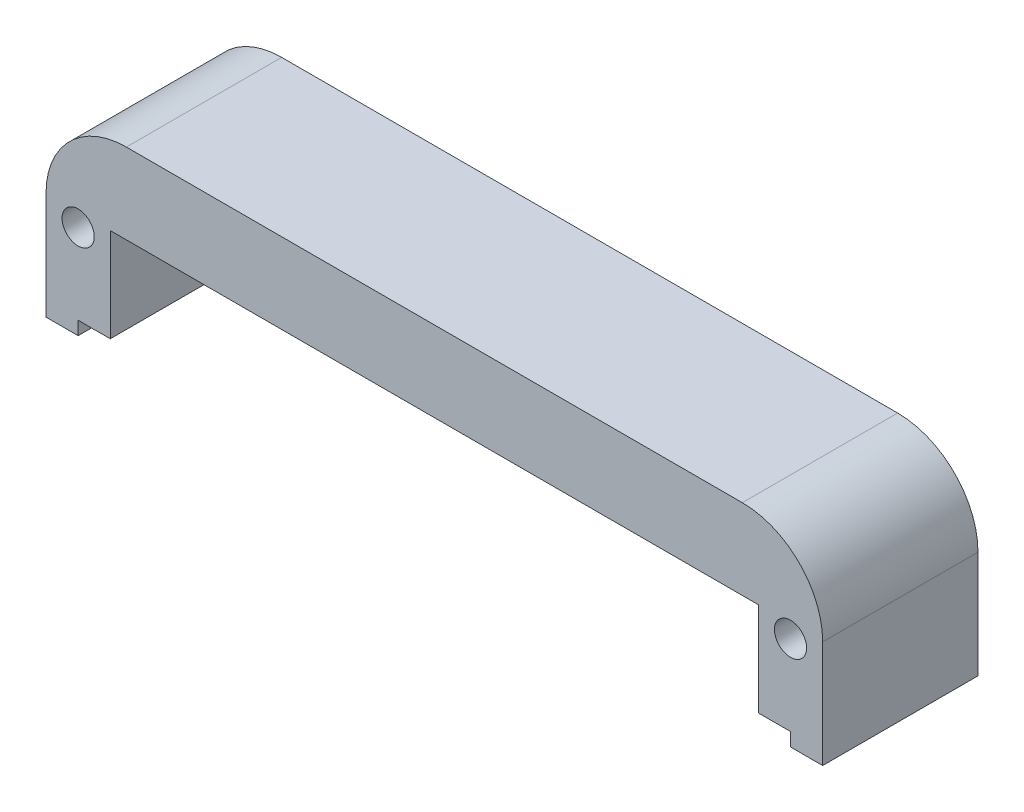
ISO-10303-21;
HEADER;
FILE_DESCRIPTION(('STEP AP214'),'2;1');
FILE_NAME('part.step','',(''),(''),'','','');
FILE_SCHEMA(('AUTOMOTIVE_DESIGN { 1 0 10303 214 1 1 1 1 }'));
ENDSEC;
DATA;
#1=APPLICATION_CONTEXT('core data for automotive mechanical design processes');
#2=APPLICATION_PROTOCOL_DEFINITION('international standard','automotive_design',2000,#1);
#3=PRODUCT_CONTEXT('',#1,'mechanical');
#4=PRODUCT('Part','Part','',(#3));
#5=PRODUCT_RELATED_PRODUCT_CATEGORY('part','',(#4));
#6=PRODUCT_DEFINITION_FORMATION('','',#4);
#7=PRODUCT_DEFINITION_CONTEXT('part definition',#1,'design');
#8=PRODUCT_DEFINITION('design','',#6,#7);
#9=PRODUCT_DEFINITION_SHAPE('','',#8);
#10=(LENGTH_UNIT() NAMED_UNIT(*) SI_UNIT(.MILLI.,.METRE.));
#11=(NAMED_UNIT(*) PLANE_ANGLE_UNIT() SI_UNIT($,.RADIAN.));
#12=(NAMED_UNIT(*) SI_UNIT($,.STERADIAN.) SOLID_ANGLE_UNIT());
#13=UNCERTAINTY_MEASURE_WITH_UNIT(LENGTH_MEASURE(1.E-05),#10,'distance_accuracy_value','');
#14=(GEOMETRIC_REPRESENTATION_CONTEXT(3) GLOBAL_UNCERTAINTY_ASSIGNED_CONTEXT((#13)) GLOBAL_UNIT_ASSIGNED_CONTEXT((#10,
#11,#12)) REPRESENTATION_CONTEXT('',''));
#15=CARTESIAN_POINT('',(0.,0.,0.));
#16=DIRECTION('',(0.,0.,1.));
#17=DIRECTION('',(1.,0.,0.));
#18=AXIS2_PLACEMENT_3D('',#15,#16,#17);
#19=CARTESIAN_POINT('',(-72.5,0.,90.));
#20=DIRECTION('',(1.,0.,0.));
#21=DIRECTION('',(0.,1.,0.));
#22=AXIS2_PLACEMENT_3D('',#19,#20,#21);
#23=PLANE('',#22);
#24=DIRECTION('',(0.,-1.,0.));
#25=VECTOR('',#24,1.);
#26=CARTESIAN_POINT('',(-72.5,20.,60.));
#27=LINE('',#26,#25);
#28=CARTESIAN_POINT('',(-72.5,20.,60.));
#29=VERTEX_POINT('',#28);
#30=CARTESIAN_POINT('',(-72.5,0.,60.));
#31=VERTEX_POINT('',#30);
#32=EDGE_CURVE('E160',#29,#31,#27,.T.);
#33=ORIENTED_EDGE('',*,*,#32,.F.);
#34=DIRECTION('',(0.,0.,-1.));
#35=VECTOR('',#34,1.);
#36=CARTESIAN_POINT('',(-72.5,20.,90.));
#37=LINE('',#36,#35);
#38=CARTESIAN_POINT('',(-72.5,20.,31.));
#39=VERTEX_POINT('',#38);
#40=EDGE_CURVE('E172',#29,#39,#37,.T.);
#41=ORIENTED_EDGE('',*,*,#40,.T.);
#42=DIRECTION('',(0.,-1.,0.));
#43=VECTOR('',#42,1.);
#44=CARTESIAN_POINT('',(-72.5,20.,31.));
#45=LINE('',#44,#43);
#46=CARTESIAN_POINT('',(-72.5,0.,31.));
#47=VERTEX_POINT('',#46);
#48=EDGE_CURVE('E264',#39,#47,#45,.T.);
#49=ORIENTED_EDGE('',*,*,#48,.T.);
#50=DIRECTION('',(0.,0.,-1.));
#51=VECTOR('',#50,1.);
#52=CARTESIAN_POINT('',(-72.5,0.,90.));
#53=LINE('',#52,#51);
#54=EDGE_CURVE('E174',#31,#47,#53,.T.);
#55=ORIENTED_EDGE('',*,*,#54,.F.);
#56=EDGE_LOOP('',(#33,#41,#49,#55));
#57=FACE_BOUND('',#56,.T.);
#58=ADVANCED_FACE('F36',(#57),#23,.F.);
#59=CARTESIAN_POINT('',(72.5,0.,90.));
#60=DIRECTION('',(0.,1.,0.));
#61=DIRECTION('',(0.,0.,1.));
#62=AXIS2_PLACEMENT_3D('',#59,#60,#61);
#63=PLANE('',#62);
#64=DIRECTION('',(1.,0.,0.));
#65=VECTOR('',#64,1.);
#66=CARTESIAN_POINT('',(-72.5,0.,60.));
#67=LINE('',#66,#65);
#68=CARTESIAN_POINT('',(-66.5,0.,60.));
#69=VERTEX_POINT('',#68);
#70=EDGE_CURVE('E373',#31,#69,#67,.T.);
#71=ORIENTED_EDGE('',*,*,#70,.F.);
#72=ORIENTED_EDGE('',*,*,#54,.T.);
#73=DIRECTION('',(1.,0.,0.));
#74=VECTOR('',#73,1.);
#75=CARTESIAN_POINT('',(-72.5,0.,31.));
#76=LINE('',#75,#74);
#77=CARTESIAN_POINT('',(-66.5,0.,31.));
#78=VERTEX_POINT('',#77);
#79=EDGE_CURVE('E267',#47,#78,#76,.T.);
#80=ORIENTED_EDGE('',*,*,#79,.T.);
#81=DIRECTION('',(0.,0.,-1.));
#82=VECTOR('',#81,1.);
#83=CARTESIAN_POINT('',(-66.5,0.,78.5));
#84=LINE('',#83,#82);
#85=EDGE_CURVE('E229',#69,#78,#84,.T.);
#86=ORIENTED_EDGE('',*,*,#85,.F.);
#87=EDGE_LOOP('',(#71,#72,#80,#86));
#88=FACE_BOUND('',#87,.T.);
#89=ADVANCED_FACE('F318',(#88),#63,.F.);
#90=CARTESIAN_POINT('',(66.5,0.,60.));
#91=VERTEX_POINT('',#90);
#92=CARTESIAN_POINT('',(72.5,0.,60.));
#93=VERTEX_POINT('',#92);
#94=EDGE_CURVE('E175',#91,#93,#67,.T.);
#95=ORIENTED_EDGE('',*,*,#94,.F.);
#96=DIRECTION('',(0.,0.,1.));
#97=VECTOR('',#96,1.);
#98=CARTESIAN_POINT('',(66.5,0.,78.5));
#99=LINE('',#98,#97);
#100=CARTESIAN_POINT('',(66.5,0.,31.));
#101=VERTEX_POINT('',#100);
#102=EDGE_CURVE('E233',#101,#91,#99,.T.);
#103=ORIENTED_EDGE('',*,*,#102,.F.);
#104=CARTESIAN_POINT('',(72.5,0.,31.));
#105=VERTEX_POINT('',#104);
#106=EDGE_CURVE('E266',#101,#105,#76,.T.);
#107=ORIENTED_EDGE('',*,*,#106,.T.);
#108=DIRECTION('',(0.,0.,-1.));
#109=VECTOR('',#108,1.);
#110=CARTESIAN_POINT('',(72.5,0.,90.));
#111=LINE('',#110,#109);
#112=EDGE_CURVE('E193',#93,#105,#111,.T.);
#113=ORIENTED_EDGE('',*,*,#112,.F.);
#114=EDGE_LOOP('',(#95,#103,#107,#113));
#115=FACE_BOUND('',#114,.T.);
#116=ADVANCED_FACE('F323',(#115),#63,.F.);
#117=CARTESIAN_POINT('',(72.5,20.,90.));
#118=DIRECTION('',(-1.,0.,0.));
#119=DIRECTION('',(0.,-1.,0.));
#120=AXIS2_PLACEMENT_3D('',#117,#118,#119);
#121=PLANE('',#120);
#122=DIRECTION('',(0.,1.,0.));
#123=VECTOR('',#122,1.);
#124=CARTESIAN_POINT('',(72.5,0.,60.));
#125=LINE('',#124,#123);
#126=CARTESIAN_POINT('',(72.5,20.,60.));
#127=VERTEX_POINT('',#126);
#128=EDGE_CURVE('E374',#93,#127,#125,.T.);
#129=ORIENTED_EDGE('',*,*,#128,.F.);
#130=ORIENTED_EDGE('',*,*,#112,.T.);
#131=DIRECTION('',(0.,1.,0.));
#132=VECTOR('',#131,1.);
#133=CARTESIAN_POINT('',(72.5,0.,31.));
#134=LINE('',#133,#132);
#135=CARTESIAN_POINT('',(72.5,20.,31.));
#136=VERTEX_POINT('',#135);
#137=EDGE_CURVE('E270',#105,#136,#134,.T.);
#138=ORIENTED_EDGE('',*,*,#137,.T.);
#139=DIRECTION('',(0.,0.,-1.));
#140=VECTOR('',#139,1.);
#141=CARTESIAN_POINT('',(72.5,20.,90.));
#142=LINE('',#141,#140);
#143=EDGE_CURVE('E191',#127,#136,#142,.T.);
#144=ORIENTED_EDGE('',*,*,#143,.F.);
#145=EDGE_LOOP('',(#129,#130,#138,#144));
#146=FACE_BOUND('',#145,.T.);
#147=ADVANCED_FACE('F326',(#146),#121,.F.);
#148=CARTESIAN_POINT('',(57.5,20.,90.));
#149=DIRECTION('',(0.,0.,-1.));
#150=DIRECTION('',(-1.,0.,0.));
#151=AXIS2_PLACEMENT_3D('',#148,#149,#150);
#152=CYLINDRICAL_SURFACE('',#151,15.);
#153=CARTESIAN_POINT('',(57.5,20.,60.));
#154=DIRECTION('',(0.,0.,1.));
#155=DIRECTION('',(1.,0.,0.));
#156=AXIS2_PLACEMENT_3D('',#153,#154,#155);
#157=CIRCLE('',#156,15.);
#158=CARTESIAN_POINT('',(57.5,35.,60.));
#159=VERTEX_POINT('',#158);
#160=EDGE_CURVE('E376',#127,#159,#157,.T.);
#161=ORIENTED_EDGE('',*,*,#160,.F.);
#162=ORIENTED_EDGE('',*,*,#143,.T.);
#163=CARTESIAN_POINT('',(57.5,20.,31.));
#164=DIRECTION('',(0.,0.,1.));
#165=DIRECTION('',(1.,0.,0.));
#166=AXIS2_PLACEMENT_3D('',#163,#164,#165);
#167=CIRCLE('',#166,15.);
#168=CARTESIAN_POINT('',(57.5,35.,31.));
#169=VERTEX_POINT('',#168);
#170=EDGE_CURVE('E273',#136,#169,#167,.T.);
#171=ORIENTED_EDGE('',*,*,#170,.T.);
#172=DIRECTION('',(0.,0.,-1.));
#173=VECTOR('',#172,1.);
#174=CARTESIAN_POINT('',(57.5,35.,90.));
#175=LINE('',#174,#173);
#176=EDGE_CURVE('E184',#159,#169,#175,.T.);
#177=ORIENTED_EDGE('',*,*,#176,.F.);
#178=EDGE_LOOP('',(#161,#162,#171,#177));
#179=FACE_BOUND('',#178,.T.);
#180=ADVANCED_FACE('F331',(#179),#152,.T.);
#181=CARTESIAN_POINT('',(-57.5,35.,90.));
#182=DIRECTION('',(0.,-1.,0.));
#183=DIRECTION('',(1.,0.,0.));
#184=AXIS2_PLACEMENT_3D('',#181,#182,#183);
#185=PLANE('',#184);
#186=DIRECTION('',(-1.,0.,0.));
#187=VECTOR('',#186,1.);
#188=CARTESIAN_POINT('',(57.5,35.,60.));
#189=LINE('',#188,#187);
#190=CARTESIAN_POINT('',(-57.5,35.,60.));
#191=VERTEX_POINT('',#190);
#192=EDGE_CURVE('E163',#159,#191,#189,.T.);
#193=ORIENTED_EDGE('',*,*,#192,.F.);
#194=ORIENTED_EDGE('',*,*,#176,.T.);
#195=DIRECTION('',(-1.,0.,0.));
#196=VECTOR('',#195,1.);
#197=CARTESIAN_POINT('',(57.5,35.,31.));
#198=LINE('',#197,#196);
#199=CARTESIAN_POINT('',(-57.5,35.,31.));
#200=VERTEX_POINT('',#199);
#201=EDGE_CURVE('E276',#169,#200,#198,.T.);
#202=ORIENTED_EDGE('',*,*,#201,.T.);
#203=DIRECTION('',(0.,0.,-1.));
#204=VECTOR('',#203,1.);
#205=CARTESIAN_POINT('',(-57.5,35.,90.));
#206=LINE('',#205,#204);
#207=EDGE_CURVE('E181',#191,#200,#206,.T.);
#208=ORIENTED_EDGE('',*,*,#207,.F.);
#209=EDGE_LOOP('',(#193,#194,#202,#208));
#210=FACE_BOUND('',#209,.T.);
#211=ADVANCED_FACE('F335',(#210),#185,.F.);
#212=CARTESIAN_POINT('',(-57.5,20.,90.));
#213=DIRECTION('',(0.,0.,-1.));
#214=DIRECTION('',(-1.,0.,0.));
#215=AXIS2_PLACEMENT_3D('',#212,#213,#214);
#216=CYLINDRICAL_SURFACE('',#215,15.);
#217=CARTESIAN_POINT('',(-57.5,20.,60.));
#218=DIRECTION('',(0.,0.,1.));
#219=DIRECTION('',(1.,0.,0.));
#220=AXIS2_PLACEMENT_3D('',#217,#218,#219);
#221=CIRCLE('',#220,15.);
#222=EDGE_CURVE('E157',#191,#29,#221,.T.);
#223=ORIENTED_EDGE('',*,*,#222,.F.);
#224=ORIENTED_EDGE('',*,*,#207,.T.);
#225=CARTESIAN_POINT('',(-57.5,20.,31.));
#226=DIRECTION('',(0.,0.,1.));
#227=DIRECTION('',(1.,0.,0.));
#228=AXIS2_PLACEMENT_3D('',#225,#226,#227);
#229=CIRCLE('',#228,15.);
#230=EDGE_CURVE('E180',#200,#39,#229,.T.);
#231=ORIENTED_EDGE('',*,*,#230,.T.);
#232=ORIENTED_EDGE('',*,*,#40,.F.);
#233=EDGE_LOOP('',(#223,#224,#231,#232));
#234=FACE_BOUND('',#233,.T.);
#235=ADVANCED_FACE('F178',(#234),#216,.T.);
#236=CARTESIAN_POINT('',(63.5,2.5,78.5));
#237=DIRECTION('',(0.,1.,0.));
#238=DIRECTION('',(0.,0.,1.));
#239=AXIS2_PLACEMENT_3D('',#236,#237,#238);
#240=PLANE('',#239);
#241=DIRECTION('',(1.,0.,0.));
#242=VECTOR('',#241,1.);
#243=CARTESIAN_POINT('',(63.5,2.5,60.));
#244=LINE('',#243,#242);
#245=CARTESIAN_POINT('',(-66.5,2.5,60.));
#246=VERTEX_POINT('',#245);
#247=CARTESIAN_POINT('',(-60.5,2.5,60.));
#248=VERTEX_POINT('',#247);
#249=EDGE_CURVE('E49',#246,#248,#244,.T.);
#250=ORIENTED_EDGE('',*,*,#249,.F.);
#251=DIRECTION('',(0.,0.,-1.));
#252=VECTOR('',#251,1.);
#253=CARTESIAN_POINT('',(-66.5,2.5,78.5));
#254=LINE('',#253,#252);
#255=CARTESIAN_POINT('',(-66.5,2.5,31.));
#256=VERTEX_POINT('',#255);
#257=EDGE_CURVE('E230',#246,#256,#254,.T.);
#258=ORIENTED_EDGE('',*,*,#257,.T.);
#259=DIRECTION('',(1.,0.,0.));
#260=VECTOR('',#259,1.);
#261=CARTESIAN_POINT('',(63.5,2.5,31.));
#262=LINE('',#261,#260);
#263=CARTESIAN_POINT('',(-60.5,2.5,31.));
#264=VERTEX_POINT('',#263);
#265=EDGE_CURVE('E287',#256,#264,#262,.T.);
#266=ORIENTED_EDGE('',*,*,#265,.T.);
#267=DIRECTION('',(0.,0.,-1.));
#268=VECTOR('',#267,1.);
#269=CARTESIAN_POINT('',(-60.5,2.5,76.5));
#270=LINE('',#269,#268);
#271=EDGE_CURVE('E236',#248,#264,#270,.T.);
#272=ORIENTED_EDGE('',*,*,#271,.F.);
#273=EDGE_LOOP('',(#250,#258,#266,#272));
#274=FACE_BOUND('',#273,.T.);
#275=ADVANCED_FACE('F342',(#274),#240,.F.);
#276=CARTESIAN_POINT('',(60.5,2.5,60.));
#277=VERTEX_POINT('',#276);
#278=CARTESIAN_POINT('',(66.5,2.5,60.));
#279=VERTEX_POINT('',#278);
#280=EDGE_CURVE('E256',#277,#279,#244,.T.);
#281=ORIENTED_EDGE('',*,*,#280,.F.);
#282=DIRECTION('',(0.,0.,1.));
#283=VECTOR('',#282,1.);
#284=CARTESIAN_POINT('',(60.5,2.5,76.5));
#285=LINE('',#284,#283);
#286=CARTESIAN_POINT('',(60.5,2.5,31.));
#287=VERTEX_POINT('',#286);
#288=EDGE_CURVE('E196',#287,#277,#285,.T.);
#289=ORIENTED_EDGE('',*,*,#288,.F.);
#290=CARTESIAN_POINT('',(66.5,2.5,31.));
#291=VERTEX_POINT('',#290);
#292=EDGE_CURVE('E290',#287,#291,#262,.T.);
#293=ORIENTED_EDGE('',*,*,#292,.T.);
#294=DIRECTION('',(0.,0.,1.));
#295=VECTOR('',#294,1.);
#296=CARTESIAN_POINT('',(66.5,2.5,78.5));
#297=LINE('',#296,#295);
#298=EDGE_CURVE('E232',#291,#279,#297,.T.);
#299=ORIENTED_EDGE('',*,*,#298,.T.);
#300=EDGE_LOOP('',(#281,#289,#293,#299));
#301=FACE_BOUND('',#300,.T.);
#302=ADVANCED_FACE('F358',(#301),#240,.F.);
#303=CARTESIAN_POINT('',(66.5,2.5,78.5));
#304=DIRECTION('',(1.,0.,0.));
#305=DIRECTION('',(0.,0.,-1.));
#306=AXIS2_PLACEMENT_3D('',#303,#304,#305);
#307=PLANE('',#306);
#308=DIRECTION('',(0.,-1.,0.));
#309=VECTOR('',#308,1.);
#310=CARTESIAN_POINT('',(66.5,2.5,60.));
#311=LINE('',#310,#309);
#312=EDGE_CURVE('E261',#279,#91,#311,.T.);
#313=ORIENTED_EDGE('',*,*,#312,.F.);
#314=ORIENTED_EDGE('',*,*,#298,.F.);
#315=DIRECTION('',(0.,-1.,0.));
#316=VECTOR('',#315,1.);
#317=CARTESIAN_POINT('',(66.5,2.5,31.));
#318=LINE('',#317,#316);
#319=EDGE_CURVE('E295',#291,#101,#318,.T.);
#320=ORIENTED_EDGE('',*,*,#319,.T.);
#321=ORIENTED_EDGE('',*,*,#102,.T.);
#322=EDGE_LOOP('',(#313,#314,#320,#321));
#323=FACE_BOUND('',#322,.T.);
#324=ADVANCED_FACE('F354',(#323),#307,.F.);
#325=CARTESIAN_POINT('',(-66.5,2.5,78.5));
#326=DIRECTION('',(-1.,0.,0.));
#327=DIRECTION('',(0.,0.,1.));
#328=AXIS2_PLACEMENT_3D('',#325,#326,#327);
#329=PLANE('',#328);
#330=DIRECTION('',(0.,1.,0.));
#331=VECTOR('',#330,1.);
#332=CARTESIAN_POINT('',(-66.5,2.5,60.));
#333=LINE('',#332,#331);
#334=EDGE_CURVE('E254',#69,#246,#333,.T.);
#335=ORIENTED_EDGE('',*,*,#334,.F.);
#336=ORIENTED_EDGE('',*,*,#85,.T.);
#337=DIRECTION('',(0.,1.,0.));
#338=VECTOR('',#337,1.);
#339=CARTESIAN_POINT('',(-66.5,2.5,31.));
#340=LINE('',#339,#338);
#341=EDGE_CURVE('E292',#78,#256,#340,.T.);
#342=ORIENTED_EDGE('',*,*,#341,.T.);
#343=ORIENTED_EDGE('',*,*,#257,.F.);
#344=EDGE_LOOP('',(#335,#336,#342,#343));
#345=FACE_BOUND('',#344,.T.);
#346=ADVANCED_FACE('F351',(#345),#329,.F.);
#347=CARTESIAN_POINT('',(0.,20.,0.));
#348=DIRECTION('',(0.,1.,0.));
#349=DIRECTION('',(0.,0.,1.));
#350=AXIS2_PLACEMENT_3D('',#347,#348,#349);
#351=PLANE('',#350);
#352=DIRECTION('',(1.,0.,0.));
#353=VECTOR('',#352,1.);
#354=CARTESIAN_POINT('',(0.,20.,60.));
#355=LINE('',#354,#353);
#356=CARTESIAN_POINT('',(-60.5,20.,60.));
#357=VERTEX_POINT('',#356);
#358=CARTESIAN_POINT('',(60.5,20.,60.));
#359=VERTEX_POINT('',#358);
#360=EDGE_CURVE('E243',#357,#359,#355,.T.);
#361=ORIENTED_EDGE('',*,*,#360,.F.);
#362=DIRECTION('',(0.,0.,-1.));
#363=VECTOR('',#362,1.);
#364=CARTESIAN_POINT('',(-60.5,20.,76.5));
#365=LINE('',#364,#363);
#366=CARTESIAN_POINT('',(-60.5,20.,31.));
#367=VERTEX_POINT('',#366);
#368=EDGE_CURVE('E182',#357,#367,#365,.T.);
#369=ORIENTED_EDGE('',*,*,#368,.T.);
#370=DIRECTION('',(1.,0.,0.));
#371=VECTOR('',#370,1.);
#372=CARTESIAN_POINT('',(0.,20.,31.));
#373=LINE('',#372,#371);
#374=CARTESIAN_POINT('',(-9.19258240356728,20.,31.));
#375=VERTEX_POINT('',#374);
#376=EDGE_CURVE('E280',#367,#375,#373,.T.);
#377=ORIENTED_EDGE('',*,*,#376,.T.);
#378=DIRECTION('',(0.,0.,-1.));
#379=VECTOR('',#378,1.);
#380=CARTESIAN_POINT('',(-9.19258240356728,20.,33.5));
#381=LINE('',#380,#379);
#382=CARTESIAN_POINT('',(-9.19258240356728,20.,33.5));
#383=VERTEX_POINT('',#382);
#384=EDGE_CURVE('E211',#375,#383,#381,.F.);
#385=ORIENTED_EDGE('',*,*,#384,.T.);
#386=DIRECTION('',(-1.,0.,0.));
#387=VECTOR('',#386,1.);
#388=CARTESIAN_POINT('',(0.,20.,33.5));
#389=LINE('',#388,#387);
#390=CARTESIAN_POINT('',(-3.80741759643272,20.,33.5));
#391=VERTEX_POINT('',#390);
#392=EDGE_CURVE('E199',#391,#383,#389,.T.);
#393=ORIENTED_EDGE('',*,*,#392,.F.);
#394=DIRECTION('',(0.,0.,-1.));
#395=VECTOR('',#394,1.);
#396=CARTESIAN_POINT('',(-3.80741759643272,20.,33.5));
#397=LINE('',#396,#395);
#398=CARTESIAN_POINT('',(-3.80741759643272,20.,31.));
#399=VERTEX_POINT('',#398);
#400=EDGE_CURVE('E209',#391,#399,#397,.T.);
#401=ORIENTED_EDGE('',*,*,#400,.T.);
#402=CARTESIAN_POINT('',(9.80741759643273,20.,31.));
#403=VERTEX_POINT('',#402);
#404=EDGE_CURVE('E57',#399,#403,#373,.T.);
#405=ORIENTED_EDGE('',*,*,#404,.T.);
#406=DIRECTION('',(0.,0.,-1.));
#407=VECTOR('',#406,1.);
#408=CARTESIAN_POINT('',(9.80741759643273,20.,33.5));
#409=LINE('',#408,#407);
#410=CARTESIAN_POINT('',(9.80741759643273,20.,33.5));
#411=VERTEX_POINT('',#410);
#412=EDGE_CURVE('E219',#403,#411,#409,.F.);
#413=ORIENTED_EDGE('',*,*,#412,.T.);
#414=DIRECTION('',(-1.,0.,0.));
#415=VECTOR('',#414,1.);
#416=CARTESIAN_POINT('',(0.,20.,33.5));
#417=LINE('',#416,#415);
#418=CARTESIAN_POINT('',(15.1925824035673,20.,33.5));
#419=VERTEX_POINT('',#418);
#420=EDGE_CURVE('E202',#419,#411,#417,.T.);
#421=ORIENTED_EDGE('',*,*,#420,.F.);
#422=DIRECTION('',(0.,0.,-1.));
#423=VECTOR('',#422,1.);
#424=CARTESIAN_POINT('',(15.1925824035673,20.,33.5));
#425=LINE('',#424,#423);
#426=CARTESIAN_POINT('',(15.1925824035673,20.,31.));
#427=VERTEX_POINT('',#426);
#428=EDGE_CURVE('E221',#419,#427,#425,.T.);
#429=ORIENTED_EDGE('',*,*,#428,.T.);
#430=CARTESIAN_POINT('',(60.5,20.,31.));
#431=VERTEX_POINT('',#430);
#432=EDGE_CURVE('E245',#427,#431,#373,.T.);
#433=ORIENTED_EDGE('',*,*,#432,.T.);
#434=DIRECTION('',(0.,0.,1.));
#435=VECTOR('',#434,1.);
#436=CARTESIAN_POINT('',(60.5,20.,76.5));
#437=LINE('',#436,#435);
#438=EDGE_CURVE('E186',#431,#359,#437,.T.);
#439=ORIENTED_EDGE('',*,*,#438,.T.);
#440=EDGE_LOOP('',(#361,#369,#377,#385,#393,#401,#405,#413,#421,#429,#433,#439));
#441=FACE_BOUND('',#440,.T.);
#442=ADVANCED_FACE('F217',(#441),#351,.F.);
#443=CARTESIAN_POINT('',(60.5,20.,76.5));
#444=DIRECTION('',(1.,0.,0.));
#445=DIRECTION('',(0.,0.,-1.));
#446=AXIS2_PLACEMENT_3D('',#443,#444,#445);
#447=PLANE('',#446);
#448=DIRECTION('',(0.,-1.,0.));
#449=VECTOR('',#448,1.);
#450=CARTESIAN_POINT('',(60.5,20.,60.));
#451=LINE('',#450,#449);
#452=EDGE_CURVE('E252',#359,#277,#451,.T.);
#453=ORIENTED_EDGE('',*,*,#452,.F.);
#454=ORIENTED_EDGE('',*,*,#438,.F.);
#455=DIRECTION('',(0.,-1.,0.));
#456=VECTOR('',#455,1.);
#457=CARTESIAN_POINT('',(60.5,20.,31.));
#458=LINE('',#457,#456);
#459=EDGE_CURVE('E250',#431,#287,#458,.T.);
#460=ORIENTED_EDGE('',*,*,#459,.T.);
#461=ORIENTED_EDGE('',*,*,#288,.T.);
#462=EDGE_LOOP('',(#453,#454,#460,#461));
#463=FACE_BOUND('',#462,.T.);
#464=ADVANCED_FACE('F249',(#463),#447,.F.);
#465=CARTESIAN_POINT('',(-60.5,20.,76.5));
#466=DIRECTION('',(-1.,0.,0.));
#467=DIRECTION('',(0.,0.,1.));
#468=AXIS2_PLACEMENT_3D('',#465,#466,#467);
#469=PLANE('',#468);
#470=DIRECTION('',(0.,1.,0.));
#471=VECTOR('',#470,1.);
#472=CARTESIAN_POINT('',(-60.5,20.,60.));
#473=LINE('',#472,#471);
#474=EDGE_CURVE('E11',#248,#357,#473,.T.);
#475=ORIENTED_EDGE('',*,*,#474,.F.);
#476=ORIENTED_EDGE('',*,*,#271,.T.);
#477=DIRECTION('',(0.,1.,0.));
#478=VECTOR('',#477,1.);
#479=CARTESIAN_POINT('',(-60.5,20.,31.));
#480=LINE('',#479,#478);
#481=EDGE_CURVE('E284',#264,#367,#480,.T.);
#482=ORIENTED_EDGE('',*,*,#481,.T.);
#483=ORIENTED_EDGE('',*,*,#368,.F.);
#484=EDGE_LOOP('',(#475,#476,#482,#483));
#485=FACE_BOUND('',#484,.T.);
#486=ADVANCED_FACE('F345',(#485),#469,.F.);
#487=CARTESIAN_POINT('',(12.5,13.,33.5));
#488=DIRECTION('',(0.,0.,-1.));
#489=DIRECTION('',(-1.,0.,0.));
#490=AXIS2_PLACEMENT_3D('',#487,#488,#489);
#491=PLANE('',#490);
#492=ORIENTED_EDGE('',*,*,#420,.T.);
#493=CARTESIAN_POINT('',(12.5,13.,33.5));
#494=DIRECTION('',(0.,0.,-1.));
#495=DIRECTION('',(-1.,0.,0.));
#496=AXIS2_PLACEMENT_3D('',#493,#494,#495);
#497=CIRCLE('',#496,7.5);
#498=EDGE_CURVE('E223',#411,#419,#497,.T.);
#499=ORIENTED_EDGE('',*,*,#498,.T.);
#500=EDGE_LOOP('',(#492,#499));
#501=FACE_BOUND('',#500,.T.);
#502=ADVANCED_FACE('F314',(#501),#491,.T.);
#503=CARTESIAN_POINT('',(12.5,13.,33.5));
#504=DIRECTION('',(0.,0.,-1.));
#505=DIRECTION('',(-1.,0.,0.));
#506=AXIS2_PLACEMENT_3D('',#503,#504,#505);
#507=CYLINDRICAL_SURFACE('',#506,7.5);
#508=ORIENTED_EDGE('',*,*,#412,.F.);
#509=CARTESIAN_POINT('',(12.5,13.,31.));
#510=DIRECTION('',(0.,0.,1.));
#511=DIRECTION('',(1.,0.,0.));
#512=AXIS2_PLACEMENT_3D('',#509,#510,#511);
#513=CIRCLE('',#512,7.5);
#514=EDGE_CURVE('E281',#403,#427,#513,.F.);
#515=ORIENTED_EDGE('',*,*,#514,.T.);
#516=ORIENTED_EDGE('',*,*,#428,.F.);
#517=ORIENTED_EDGE('',*,*,#498,.F.);
#518=EDGE_LOOP('',(#508,#515,#516,#517));
#519=FACE_BOUND('',#518,.T.);
#520=ADVANCED_FACE('F303',(#519),#507,.F.);
#521=CARTESIAN_POINT('',(-6.5,13.,33.5));
#522=DIRECTION('',(0.,0.,-1.));
#523=DIRECTION('',(-1.,0.,0.));
#524=AXIS2_PLACEMENT_3D('',#521,#522,#523);
#525=PLANE('',#524);
#526=ORIENTED_EDGE('',*,*,#392,.T.);
#527=CARTESIAN_POINT('',(-6.5,13.,33.5));
#528=DIRECTION('',(0.,0.,-1.));
#529=DIRECTION('',(-1.,0.,0.));
#530=AXIS2_PLACEMENT_3D('',#527,#528,#529);
#531=CIRCLE('',#530,7.5);
#532=EDGE_CURVE('E298',#383,#391,#531,.T.);
#533=ORIENTED_EDGE('',*,*,#532,.T.);
#534=EDGE_LOOP('',(#526,#533));
#535=FACE_BOUND('',#534,.T.);
#536=ADVANCED_FACE('F301',(#535),#525,.T.);
#537=CARTESIAN_POINT('',(-6.5,13.,33.5));
#538=DIRECTION('',(0.,0.,-1.));
#539=DIRECTION('',(-1.,0.,0.));
#540=AXIS2_PLACEMENT_3D('',#537,#538,#539);
#541=CYLINDRICAL_SURFACE('',#540,7.5);
#542=ORIENTED_EDGE('',*,*,#384,.F.);
#543=CARTESIAN_POINT('',(-6.5,13.,31.));
#544=DIRECTION('',(0.,0.,1.));
#545=DIRECTION('',(1.,0.,0.));
#546=AXIS2_PLACEMENT_3D('',#543,#544,#545);
#547=CIRCLE('',#546,7.5);
#548=EDGE_CURVE('E43',#375,#399,#547,.F.);
#549=ORIENTED_EDGE('',*,*,#548,.T.);
#550=ORIENTED_EDGE('',*,*,#400,.F.);
#551=ORIENTED_EDGE('',*,*,#532,.F.);
#552=EDGE_LOOP('',(#542,#549,#550,#551));
#553=FACE_BOUND('',#552,.T.);
#554=ADVANCED_FACE('F207',(#553),#541,.F.);
#555=CARTESIAN_POINT('',(-57.5,20.,31.));
#556=DIRECTION('',(0.,0.,1.));
#557=DIRECTION('',(1.,0.,0.));
#558=AXIS2_PLACEMENT_3D('',#555,#556,#557);
#559=PLANE('',#558);
#560=CARTESIAN_POINT('',(-66.5,17.5,31.));
#561=DIRECTION('',(0.,0.,1.));
#562=DIRECTION('',(1.,0.,0.));
#563=AXIS2_PLACEMENT_3D('',#560,#561,#562);
#564=CIRCLE('',#563,3.00000000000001);
#565=CARTESIAN_POINT('',(-63.5,17.5,31.));
#566=VERTEX_POINT('',#565);
#567=EDGE_CURVE('E167',#566,#566,#564,.T.);
#568=ORIENTED_EDGE('',*,*,#567,.T.);
#569=EDGE_LOOP('',(#568));
#570=FACE_BOUND('',#569,.T.);
#571=CARTESIAN_POINT('',(66.5,17.5,31.));
#572=DIRECTION('',(0.,0.,1.));
#573=DIRECTION('',(1.,0.,0.));
#574=AXIS2_PLACEMENT_3D('',#571,#572,#573);
#575=CIRCLE('',#574,3.00000000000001);
#576=CARTESIAN_POINT('',(69.5,17.5,31.));
#577=VERTEX_POINT('',#576);
#578=EDGE_CURVE('E424',#577,#577,#575,.T.);
#579=ORIENTED_EDGE('',*,*,#578,.T.);
#580=EDGE_LOOP('',(#579));
#581=FACE_BOUND('',#580,.T.);
#582=ORIENTED_EDGE('',*,*,#292,.F.);
#583=ORIENTED_EDGE('',*,*,#459,.F.);
#584=ORIENTED_EDGE('',*,*,#432,.F.);
#585=ORIENTED_EDGE('',*,*,#514,.F.);
#586=ORIENTED_EDGE('',*,*,#404,.F.);
#587=ORIENTED_EDGE('',*,*,#548,.F.);
#588=ORIENTED_EDGE('',*,*,#376,.F.);
#589=ORIENTED_EDGE('',*,*,#481,.F.);
#590=ORIENTED_EDGE('',*,*,#265,.F.);
#591=ORIENTED_EDGE('',*,*,#341,.F.);
#592=ORIENTED_EDGE('',*,*,#79,.F.);
#593=ORIENTED_EDGE('',*,*,#48,.F.);
#594=ORIENTED_EDGE('',*,*,#230,.F.);
#595=ORIENTED_EDGE('',*,*,#201,.F.);
#596=ORIENTED_EDGE('',*,*,#170,.F.);
#597=ORIENTED_EDGE('',*,*,#137,.F.);
#598=ORIENTED_EDGE('',*,*,#106,.F.);
#599=ORIENTED_EDGE('',*,*,#319,.F.);
#600=EDGE_LOOP('',(#582,#583,#584,#585,#586,#587,#588,#589,#590,#591,#592,#593,#594,#595,#596,
#597,#598,#599));
#601=FACE_BOUND('',#600,.T.);
#602=ADVANCED_FACE('F311',(#570,#581,#601),#559,.F.);
#603=CARTESIAN_POINT('',(-57.5,20.,60.));
#604=DIRECTION('',(0.,0.,1.));
#605=DIRECTION('',(1.,0.,0.));
#606=AXIS2_PLACEMENT_3D('',#603,#604,#605);
#607=PLANE('',#606);
#608=CARTESIAN_POINT('',(-66.5,17.5,60.));
#609=DIRECTION('',(0.,0.,1.));
#610=DIRECTION('',(1.,0.,0.));
#611=AXIS2_PLACEMENT_3D('',#608,#609,#610);
#612=CIRCLE('',#611,3.00000000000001);
#613=CARTESIAN_POINT('',(-63.5,17.5,60.));
#614=VERTEX_POINT('',#613);
#615=EDGE_CURVE('E423',#614,#614,#612,.T.);
#616=ORIENTED_EDGE('',*,*,#615,.F.);
#617=EDGE_LOOP('',(#616));
#618=FACE_BOUND('',#617,.T.);
#619=CARTESIAN_POINT('',(66.5,17.5,60.));
#620=DIRECTION('',(0.,0.,1.));
#621=DIRECTION('',(1.,0.,0.));
#622=AXIS2_PLACEMENT_3D('',#619,#620,#621);
#623=CIRCLE('',#622,3.00000000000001);
#624=CARTESIAN_POINT('',(69.5,17.5,60.));
#625=VERTEX_POINT('',#624);
#626=EDGE_CURVE('E428',#625,#625,#623,.T.);
#627=ORIENTED_EDGE('',*,*,#626,.F.);
#628=EDGE_LOOP('',(#627));
#629=FACE_BOUND('',#628,.T.);
#630=ORIENTED_EDGE('',*,*,#312,.T.);
#631=ORIENTED_EDGE('',*,*,#94,.T.);
#632=ORIENTED_EDGE('',*,*,#128,.T.);
#633=ORIENTED_EDGE('',*,*,#160,.T.);
#634=ORIENTED_EDGE('',*,*,#192,.T.);
#635=ORIENTED_EDGE('',*,*,#222,.T.);
#636=ORIENTED_EDGE('',*,*,#32,.T.);
#637=ORIENTED_EDGE('',*,*,#70,.T.);
#638=ORIENTED_EDGE('',*,*,#334,.T.);
#639=ORIENTED_EDGE('',*,*,#249,.T.);
#640=ORIENTED_EDGE('',*,*,#474,.T.);
#641=ORIENTED_EDGE('',*,*,#360,.T.);
#642=ORIENTED_EDGE('',*,*,#452,.T.);
#643=ORIENTED_EDGE('',*,*,#280,.T.);
#644=EDGE_LOOP('',(#630,#631,#632,#633,#634,#635,#636,#637,#638,#639,#640,#641,#642,#643));
#645=FACE_BOUND('',#644,.T.);
#646=ADVANCED_FACE('F159',(#618,#629,#645),#607,.T.);
#647=CARTESIAN_POINT('',(66.5,17.5,31.));
#648=DIRECTION('',(0.,0.,1.));
#649=DIRECTION('',(1.,0.,0.));
#650=AXIS2_PLACEMENT_3D('',#647,#648,#649);
#651=CYLINDRICAL_SURFACE('',#650,3.00000000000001);
#652=ORIENTED_EDGE('',*,*,#578,.F.);
#653=EDGE_LOOP('',(#652));
#654=FACE_BOUND('',#653,.T.);
#655=ORIENTED_EDGE('',*,*,#626,.T.);
#656=EDGE_LOOP('',(#655));
#657=FACE_BOUND('',#656,.T.);
#658=ADVANCED_FACE('F408',(#654,#657),#651,.F.);
#659=CARTESIAN_POINT('',(-66.5,17.5,31.));
#660=DIRECTION('',(0.,0.,1.));
#661=DIRECTION('',(1.,0.,0.));
#662=AXIS2_PLACEMENT_3D('',#659,#660,#661);
#663=CYLINDRICAL_SURFACE('',#662,3.00000000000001);
#664=ORIENTED_EDGE('',*,*,#567,.F.);
#665=EDGE_LOOP('',(#664));
#666=FACE_BOUND('',#665,.T.);
#667=ORIENTED_EDGE('',*,*,#615,.T.);
#668=EDGE_LOOP('',(#667));
#669=FACE_BOUND('',#668,.T.);
#670=ADVANCED_FACE('F412',(#666,#669),#663,.F.);
#671=CLOSED_SHELL('',(#58,#89,#116,#147,#180,#211,#235,#275,#302,#324,#346,#442,#464,#486,#502,
#520,#536,#554,#602,#646,#658,#670));
#672=MANIFOLD_SOLID_BREP('B2',#671);
#673=ADVANCED_BREP_SHAPE_REPRESENTATION('',(#18,#672),#14);
#674=SHAPE_DEFINITION_REPRESENTATION(#9,#673);
ENDSEC;
END-ISO-10303-21;
